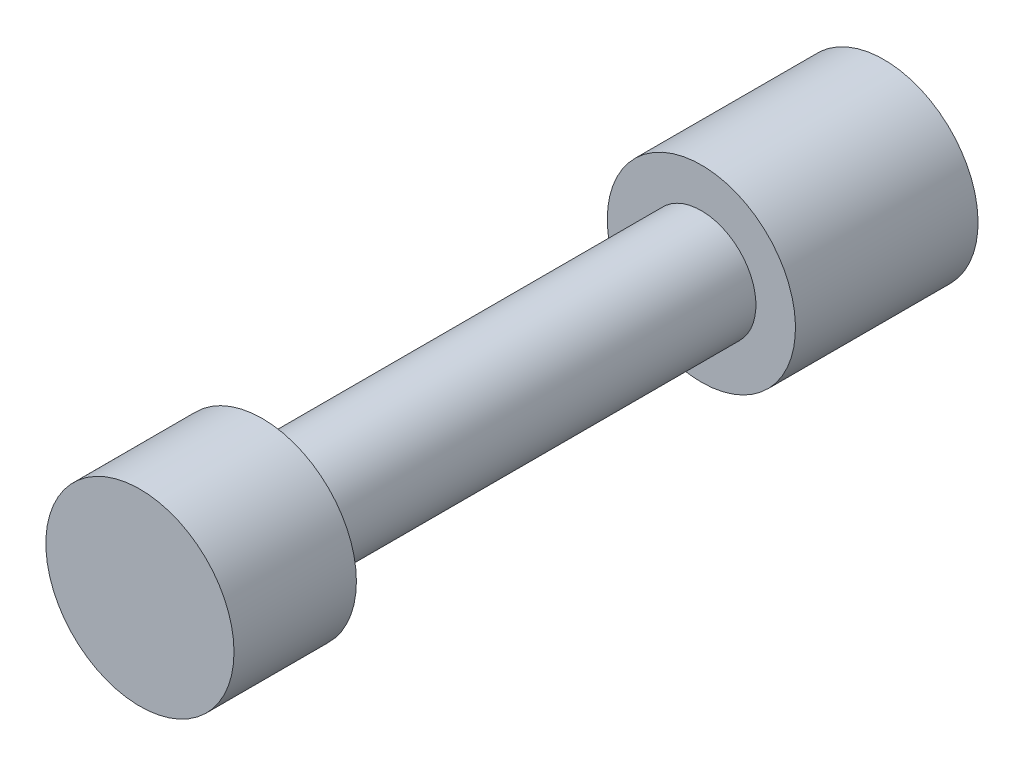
from build123d import *

# Parameters (mm, degrees)
SKETCH1_R           = 14.2875
BOSS_EXTRUDE1_DEPTH = 18.58645
SKETCH2_R           = 8.2804
BOSS_EXTRUDE2_DEPTH = 94.9198
SKETCH3_R           = 14.2875
BOSS_EXTRUDE3_DEPTH = 27.727275


with BuildPart() as part:
    # Sketch1 → Boss-Extrude1 (new body)
    with BuildSketch(Plane.XY):
        Circle(SKETCH1_R)
    extrude(amount=-BOSS_EXTRUDE1_DEPTH)

    # Sketch2 → Boss-Extrude2 (add)
    with BuildSketch(Plane(origin=(0, 0, -18.58645), x_dir=(-1, 0, 0), z_dir=(0, 0, -1))):
        with Locations(Location((0, 0, 0), (0, 0, 90))):
            Circle(SKETCH2_R)
    extrude(amount=BOSS_EXTRUDE2_DEPTH)

    # Sketch3 → Boss-Extrude3 (add)
    with BuildSketch(Plane(origin=(0, 0, -85.26145), x_dir=(-1, 0, 0), z_dir=(0, 0, -1))):
        with Locations(Location((0, 0, 0), (0, 0, 180))):
            Circle(SKETCH3_R)
    extrude(amount=BOSS_EXTRUDE3_DEPTH)


solid = part.part
